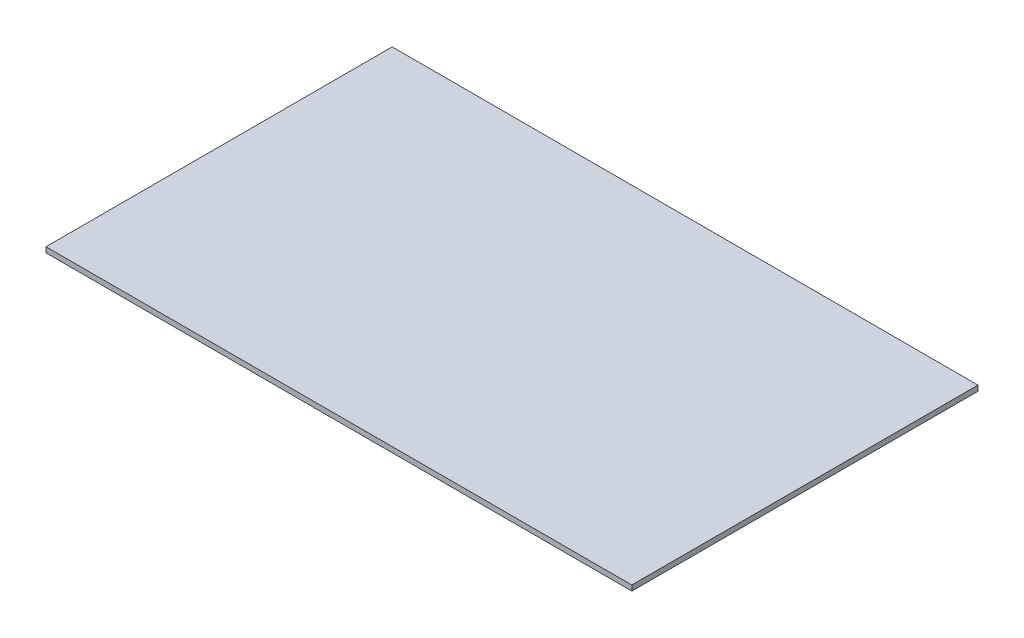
from build123d import *

# Parameters (mm, degrees)
SKETCH1_W           = 220
SKETCH1_H           = 130
BOSS_EXTRUDE1_DEPTH = 2


with BuildPart() as part:
    # Sketch1 → Boss-Extrude1 (new body)
    with BuildSketch(Plane(origin=(0, 0, 0), x_dir=(1, 0, 0), z_dir=(0, 1, 0))):
        Rectangle(SKETCH1_W, SKETCH1_H)
    extrude(amount=BOSS_EXTRUDE1_DEPTH)


solid = part.part
